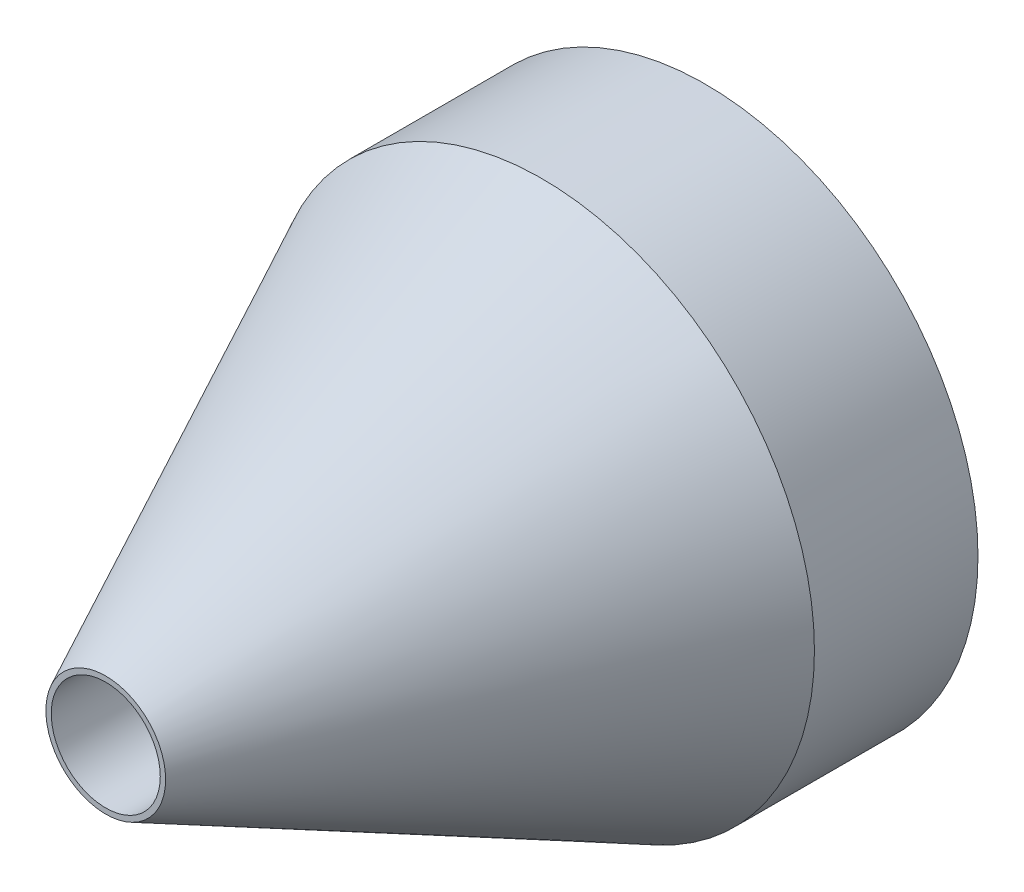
from build123d import *

# Parameters (mm, degrees)
ESQUISSE1_R             = 25
BOSS_EXTRU_1_DEPTH      = 15
ESQUISSE2_R             = 25
BOSS_EXTRU_2_DEPTH      = 40
BOSS_EXTRU_2_TAPER      = 26
ESQUISSE3_R             = 19.75
ENL_V_MAT_EXTRU_1_DEPTH = 15
ESQUISSE5_R             = 5
ENL_V_MAT_EXTRU_3_DEPTH = 45
CHANFREIN1_SIZE         = 1.5


with BuildPart() as part:
    # Esquisse1 → Boss.-Extru.1 (new body)
    with BuildSketch(Plane.XY):
        Circle(ESQUISSE1_R)
    extrude(amount=BOSS_EXTRU_1_DEPTH)

    # Esquisse2 → Boss.-Extru.2 (add)
    with BuildSketch(Plane.XY.offset(15)):
        Circle(ESQUISSE2_R)
    extrude(amount=BOSS_EXTRU_2_DEPTH, taper=BOSS_EXTRU_2_TAPER)

    # Esquisse3 → Enl_v. mat.-Extru.1 (cut)
    with BuildSketch(Plane(origin=(0, 0, 0), x_dir=(-1, 0, 0), z_dir=(0, 0, -1))):
        Circle(ESQUISSE3_R)
    extrude(amount=-ENL_V_MAT_EXTRU_1_DEPTH, mode=Mode.SUBTRACT)

    # Enl_v. mat.-Extru.2 cone 1 section (on through the dimple's axis) → Enl_v. mat.-Extru.2 (revolve, cut)
    with BuildSketch(Plane(origin=(0, 0, 15), x_dir=(0, 1, 0), z_dir=(1, 0, 0))):
        Polygon((0, 0), (20.15, 0), (0, 43.211814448), align=None)
    revolve(axis=Axis((0, 0, 15), (0, 0, 1)), mode=Mode.SUBTRACT)

    # Esquisse5 → Enl_v. mat.-Extru.3 (cut)
    with BuildSketch(Plane.XY.offset(55)):
        Circle(ESQUISSE5_R)
    extrude(amount=-ENL_V_MAT_EXTRU_3_DEPTH, mode=Mode.SUBTRACT)

    # Chanfrein1
    chanfrein1_edges = [part.edges().sort_by_distance(p)[0] for p in [
        (19.75, 0, 0),
    ]]
    chamfer(chanfrein1_edges, length=CHANFREIN1_SIZE)


solid = part.part
